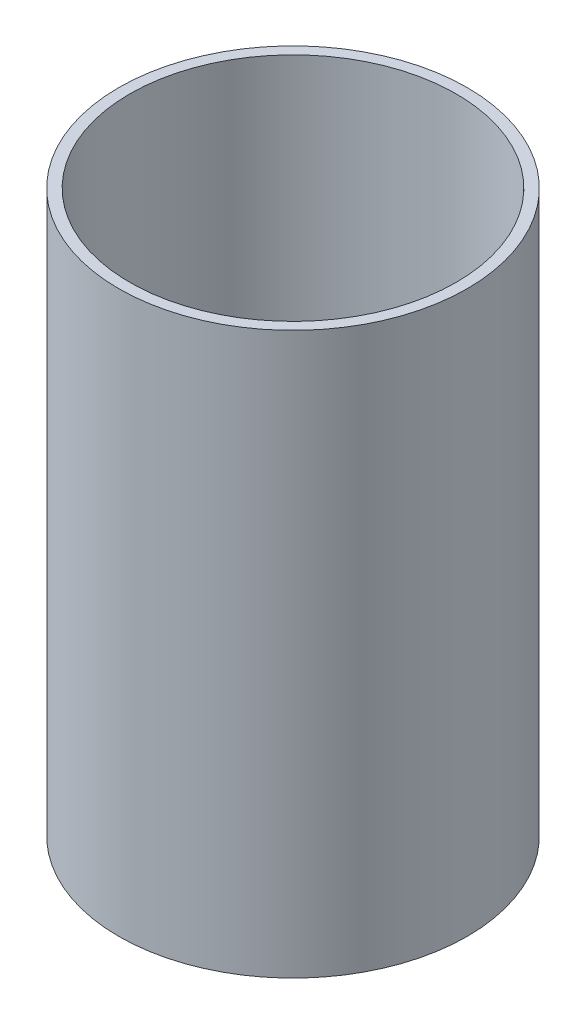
from build123d import *

# Parameters (mm, degrees)
SKIZZE1_R                    = 79.5
SKIZZE1_R_2                  = 74.5
LINEAR_AUSTRAGEN_D_NN1_DEPTH = 256


with BuildPart() as part:
    # Skizze1 → Linear-Austragen-D_nn1 (new body)
    with BuildSketch(Plane(origin=(0, 0, 0), x_dir=(1, 0, 0), z_dir=(0, 1, 0))):
        Circle(SKIZZE1_R)
        Circle(SKIZZE1_R_2, mode=Mode.SUBTRACT)
    extrude(amount=LINEAR_AUSTRAGEN_D_NN1_DEPTH)


solid = part.part
